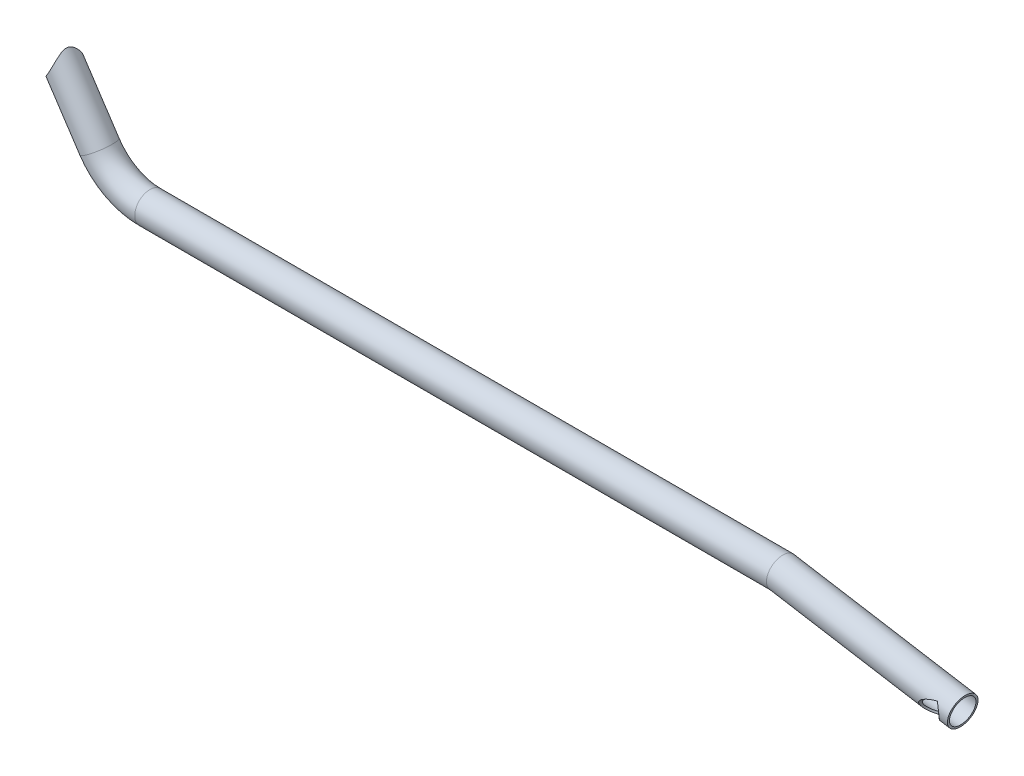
from build123d import *

# Parameters (mm, degrees)
ESQUISSE2_R             = 15
ESQUISSE2_R_2           = 13
ESQUISSE3_R             = 15
ENL_V_MAT_EXTRU_1_DEPTH = 310
ESQUISSE4_R             = 30
ENL_V_MAT_EXTRU_2_DEPTH = 110


with BuildPart() as part:
    # Balayage1: sweep along a path in Esquisse1
    with BuildLine(Plane.XY) as balayage1_path:
        Line((-442.83, 0), (-397.791987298, -68.098220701))
        ThreePointArc((-397.791987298, -68.098220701), (-376.155614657, -87.848336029), (-347.746929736, -95))
        Line((-347.746929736, -95), (280, -95))
        Line((280, -95), (460, -125))
    # Esquisse2 → Balayage1 (sweep)
    with BuildSketch(Plane(origin=(460, -125, 0), x_dir=(0, 0, -1), z_dir=(0.9863939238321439, -0.16439898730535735, 0))):
        Circle(ESQUISSE2_R)
        Circle(ESQUISSE2_R_2, mode=Mode.SUBTRACT)
    sweep(path=balayage1_path.line, transition=Transition.RIGHT)

    # Esquisse3 → Enl_v. mat.-Extru.1 (cut)
    with BuildSketch(Plane(origin=(-24.315182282, -3.282492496, 27.941380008), x_dir=(0.7563831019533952, -0.053448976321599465, 0.6519415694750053), z_dir=(-0.6538977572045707, -0.08827466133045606, 0.7514155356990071))):
        with Locations((355.090844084, -136.557204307)):
            Circle(ESQUISSE3_R)
    extrude(amount=-ENL_V_MAT_EXTRU_1_DEPTH, mode=Mode.SUBTRACT)

    # Esquisse4 → Enl_v. mat.-Extru.2 (cut)
    with BuildSketch(Plane(origin=(-24.355555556, 0, 134.817680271), x_dir=(0.9840706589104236, 0, 0.17777777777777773), z_dir=(-0.17777777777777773, 0, 0.9840706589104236))):
        with Locations((-450, 0)):
            Circle(ESQUISSE4_R)
    extrude(amount=-ENL_V_MAT_EXTRU_2_DEPTH, mode=Mode.SUBTRACT)


solid = part.part
